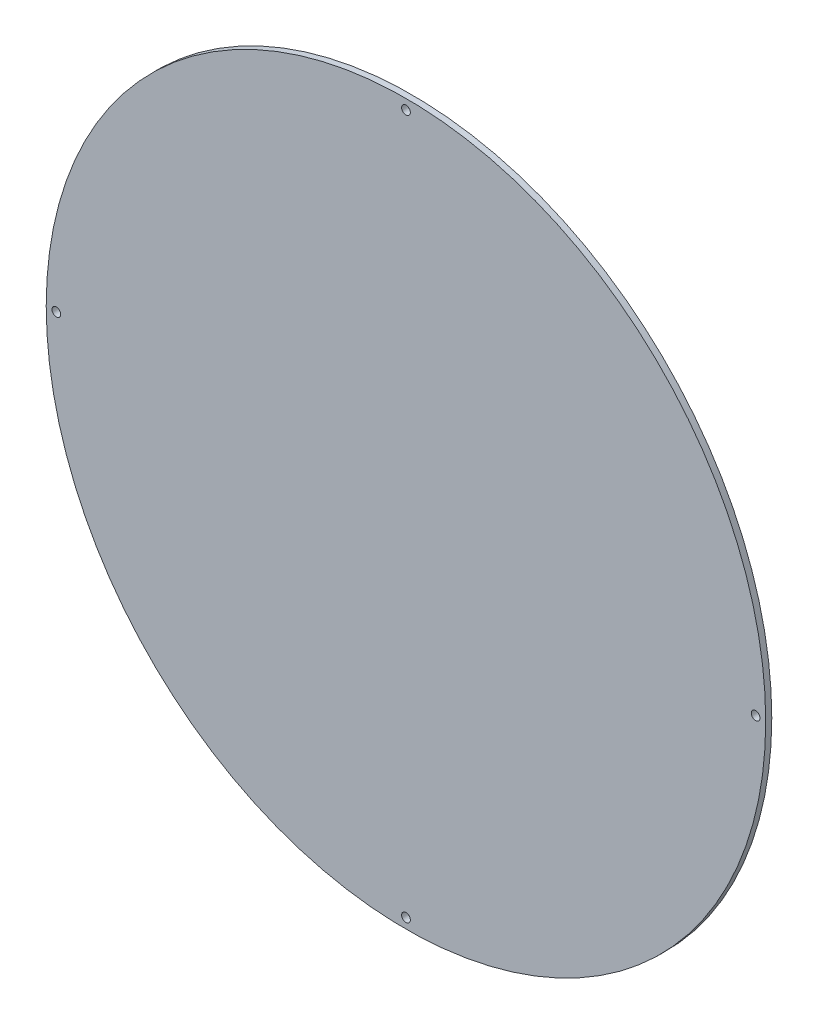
ISO-10303-21;
HEADER;
FILE_DESCRIPTION(('STEP AP214'),'2;1');
FILE_NAME('part.step','',(''),(''),'','','');
FILE_SCHEMA(('AUTOMOTIVE_DESIGN { 1 0 10303 214 1 1 1 1 }'));
ENDSEC;
DATA;
#1=APPLICATION_CONTEXT('core data for automotive mechanical design processes');
#2=APPLICATION_PROTOCOL_DEFINITION('international standard','automotive_design',2000,#1);
#3=PRODUCT_CONTEXT('',#1,'mechanical');
#4=PRODUCT('Part','Part','',(#3));
#5=PRODUCT_RELATED_PRODUCT_CATEGORY('part','',(#4));
#6=PRODUCT_DEFINITION_FORMATION('','',#4);
#7=PRODUCT_DEFINITION_CONTEXT('part definition',#1,'design');
#8=PRODUCT_DEFINITION('design','',#6,#7);
#9=PRODUCT_DEFINITION_SHAPE('','',#8);
#10=(LENGTH_UNIT() NAMED_UNIT(*) SI_UNIT(.MILLI.,.METRE.));
#11=(NAMED_UNIT(*) PLANE_ANGLE_UNIT() SI_UNIT($,.RADIAN.));
#12=(NAMED_UNIT(*) SI_UNIT($,.STERADIAN.) SOLID_ANGLE_UNIT());
#13=UNCERTAINTY_MEASURE_WITH_UNIT(LENGTH_MEASURE(1.E-05),#10,'distance_accuracy_value','');
#14=(GEOMETRIC_REPRESENTATION_CONTEXT(3) GLOBAL_UNCERTAINTY_ASSIGNED_CONTEXT((#13)) GLOBAL_UNIT_ASSIGNED_CONTEXT((#10,
#11,#12)) REPRESENTATION_CONTEXT('',''));
#15=CARTESIAN_POINT('',(0.,0.,0.));
#16=DIRECTION('',(0.,0.,1.));
#17=DIRECTION('',(1.,0.,0.));
#18=AXIS2_PLACEMENT_3D('',#15,#16,#17);
#19=CARTESIAN_POINT('',(0.,0.,3.00000000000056));
#20=DIRECTION('',(0.,0.,-1.));
#21=DIRECTION('',(-1.,0.,0.));
#22=AXIS2_PLACEMENT_3D('',#19,#20,#21);
#23=CYLINDRICAL_SURFACE('',#22,177.8);
#24=CARTESIAN_POINT('',(0.,0.,3.00000000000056));
#25=DIRECTION('',(0.,0.,1.));
#26=DIRECTION('',(1.,0.,0.));
#27=AXIS2_PLACEMENT_3D('',#24,#25,#26);
#28=CIRCLE('',#27,177.8);
#29=CARTESIAN_POINT('',(177.8,0.,3.00000000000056));
#30=VERTEX_POINT('',#29);
#31=EDGE_CURVE('E10',#30,#30,#28,.T.);
#32=ORIENTED_EDGE('',*,*,#31,.F.);
#33=EDGE_LOOP('',(#32));
#34=FACE_BOUND('',#33,.T.);
#35=CARTESIAN_POINT('',(0.,0.,0.));
#36=DIRECTION('',(0.,0.,1.));
#37=DIRECTION('',(1.,0.,0.));
#38=AXIS2_PLACEMENT_3D('',#35,#36,#37);
#39=CIRCLE('',#38,177.8);
#40=CARTESIAN_POINT('',(177.8,0.,0.));
#41=VERTEX_POINT('',#40);
#42=EDGE_CURVE('E44',#41,#41,#39,.T.);
#43=ORIENTED_EDGE('',*,*,#42,.T.);
#44=EDGE_LOOP('',(#43));
#45=FACE_BOUND('',#44,.T.);
#46=ADVANCED_FACE('F37',(#34,#45),#23,.T.);
#47=CARTESIAN_POINT('',(0.,0.,3.00000000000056));
#48=DIRECTION('',(0.,0.,1.));
#49=DIRECTION('',(1.,0.,0.));
#50=AXIS2_PLACEMENT_3D('',#47,#48,#49);
#51=PLANE('',#50);
#52=CARTESIAN_POINT('',(1.19348975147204E-12,-172.8,3.00000000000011));
#53=DIRECTION('',(0.,0.,1.));
#54=DIRECTION('',(0.,-1.,0.));
#55=AXIS2_PLACEMENT_3D('',#52,#53,#54);
#56=CIRCLE('',#55,2.14999999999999);
#57=CARTESIAN_POINT('',(1.21591057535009E-12,-174.95,3.00000000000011));
#58=VERTEX_POINT('',#57);
#59=EDGE_CURVE('E68',#58,#58,#56,.T.);
#60=ORIENTED_EDGE('',*,*,#59,.F.);
#61=EDGE_LOOP('',(#60));
#62=FACE_BOUND('',#61,.T.);
#63=CARTESIAN_POINT('',(-172.8,5.55111512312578E-13,2.99999999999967));
#64=DIRECTION('',(0.,0.,1.));
#65=DIRECTION('',(-1.,0.,0.));
#66=AXIS2_PLACEMENT_3D('',#63,#64,#65);
#67=CIRCLE('',#66,2.14999999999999);
#68=CARTESIAN_POINT('',(-174.95,5.55016406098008E-13,2.99999999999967));
#69=VERTEX_POINT('',#68);
#70=EDGE_CURVE('E62',#69,#69,#67,.T.);
#71=ORIENTED_EDGE('',*,*,#70,.F.);
#72=EDGE_LOOP('',(#71));
#73=FACE_BOUND('',#72,.T.);
#74=CARTESIAN_POINT('',(0.,172.8,2.99999999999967));
#75=DIRECTION('',(0.,0.,1.));
#76=DIRECTION('',(0.,1.,0.));
#77=AXIS2_PLACEMENT_3D('',#74,#75,#76);
#78=CIRCLE('',#77,2.14999999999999);
#79=CARTESIAN_POINT('',(0.,174.95,2.99999999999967));
#80=VERTEX_POINT('',#79);
#81=EDGE_CURVE('E56',#80,#80,#78,.T.);
#82=ORIENTED_EDGE('',*,*,#81,.F.);
#83=EDGE_LOOP('',(#82));
#84=FACE_BOUND('',#83,.T.);
#85=CARTESIAN_POINT('',(172.8,-6.66133814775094E-13,2.99999999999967));
#86=DIRECTION('',(0.,0.,1.));
#87=DIRECTION('',(1.,0.,0.));
#88=AXIS2_PLACEMENT_3D('',#85,#86,#87);
#89=CIRCLE('',#88,2.14999999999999);
#90=CARTESIAN_POINT('',(174.95,-6.66038708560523E-13,2.99999999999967));
#91=VERTEX_POINT('',#90);
#92=EDGE_CURVE('E50',#91,#91,#89,.T.);
#93=ORIENTED_EDGE('',*,*,#92,.F.);
#94=EDGE_LOOP('',(#93));
#95=FACE_BOUND('',#94,.T.);
#96=ORIENTED_EDGE('',*,*,#31,.T.);
#97=EDGE_LOOP('',(#96));
#98=FACE_BOUND('',#97,.T.);
#99=ADVANCED_FACE('F75',(#62,#73,#84,#95,#98),#51,.T.);
#100=CARTESIAN_POINT('',(0.,0.,0.));
#101=DIRECTION('',(0.,0.,1.));
#102=DIRECTION('',(1.,0.,0.));
#103=AXIS2_PLACEMENT_3D('',#100,#101,#102);
#104=PLANE('',#103);
#105=CARTESIAN_POINT('',(1.27675647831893E-12,-172.8,0.));
#106=DIRECTION('',(0.,0.,1.));
#107=DIRECTION('',(0.,-1.,0.));
#108=AXIS2_PLACEMENT_3D('',#105,#106,#107);
#109=CIRCLE('',#108,2.14999999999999);
#110=CARTESIAN_POINT('',(1.29917730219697E-12,-174.95,0.));
#111=VERTEX_POINT('',#110);
#112=EDGE_CURVE('E65',#111,#111,#109,.T.);
#113=ORIENTED_EDGE('',*,*,#112,.T.);
#114=EDGE_LOOP('',(#113));
#115=FACE_BOUND('',#114,.T.);
#116=CARTESIAN_POINT('',(-172.8,5.55111512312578E-13,0.));
#117=DIRECTION('',(0.,0.,1.));
#118=DIRECTION('',(-1.,0.,0.));
#119=AXIS2_PLACEMENT_3D('',#116,#117,#118);
#120=CIRCLE('',#119,2.14999999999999);
#121=CARTESIAN_POINT('',(-174.95,5.55016406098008E-13,0.));
#122=VERTEX_POINT('',#121);
#123=EDGE_CURVE('E59',#122,#122,#120,.T.);
#124=ORIENTED_EDGE('',*,*,#123,.T.);
#125=EDGE_LOOP('',(#124));
#126=FACE_BOUND('',#125,.T.);
#127=CARTESIAN_POINT('',(0.,172.8,4.44089209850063E-13));
#128=DIRECTION('',(0.,0.,1.));
#129=DIRECTION('',(0.,1.,0.));
#130=AXIS2_PLACEMENT_3D('',#127,#128,#129);
#131=CIRCLE('',#130,2.14999999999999);
#132=CARTESIAN_POINT('',(0.,174.95,4.43940023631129E-13));
#133=VERTEX_POINT('',#132);
#134=EDGE_CURVE('E53',#133,#133,#131,.T.);
#135=ORIENTED_EDGE('',*,*,#134,.T.);
#136=EDGE_LOOP('',(#135));
#137=FACE_BOUND('',#136,.T.);
#138=CARTESIAN_POINT('',(172.8,-6.66133814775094E-13,-4.44089209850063E-13));
#139=DIRECTION('',(0.,0.,1.));
#140=DIRECTION('',(1.,0.,0.));
#141=AXIS2_PLACEMENT_3D('',#138,#139,#140);
#142=CIRCLE('',#141,2.14999999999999);
#143=CARTESIAN_POINT('',(174.95,-6.66038708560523E-13,-4.44029535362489E-13));
#144=VERTEX_POINT('',#143);
#145=EDGE_CURVE('E40',#144,#144,#142,.T.);
#146=ORIENTED_EDGE('',*,*,#145,.T.);
#147=EDGE_LOOP('',(#146));
#148=FACE_BOUND('',#147,.T.);
#149=ORIENTED_EDGE('',*,*,#42,.F.);
#150=EDGE_LOOP('',(#149));
#151=FACE_BOUND('',#150,.T.);
#152=ADVANCED_FACE('F78',(#115,#126,#137,#148,#151),#104,.F.);
#153=CARTESIAN_POINT('',(172.8,-6.66133814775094E-13,2.99999999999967));
#154=DIRECTION('',(0.,0.,1.));
#155=DIRECTION('',(1.,0.,0.));
#156=AXIS2_PLACEMENT_3D('',#153,#154,#155);
#157=CYLINDRICAL_SURFACE('',#156,2.14999999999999);
#158=ORIENTED_EDGE('',*,*,#92,.T.);
#159=EDGE_LOOP('',(#158));
#160=FACE_BOUND('',#159,.T.);
#161=ORIENTED_EDGE('',*,*,#145,.F.);
#162=EDGE_LOOP('',(#161));
#163=FACE_BOUND('',#162,.T.);
#164=ADVANCED_FACE('F86',(#160,#163),#157,.F.);
#165=CARTESIAN_POINT('',(0.,172.8,2.99999999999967));
#166=DIRECTION('',(0.,0.,1.));
#167=DIRECTION('',(0.,1.,0.));
#168=AXIS2_PLACEMENT_3D('',#165,#166,#167);
#169=CYLINDRICAL_SURFACE('',#168,2.14999999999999);
#170=ORIENTED_EDGE('',*,*,#81,.T.);
#171=EDGE_LOOP('',(#170));
#172=FACE_BOUND('',#171,.T.);
#173=ORIENTED_EDGE('',*,*,#134,.F.);
#174=EDGE_LOOP('',(#173));
#175=FACE_BOUND('',#174,.T.);
#176=ADVANCED_FACE('F89',(#172,#175),#169,.F.);
#177=CARTESIAN_POINT('',(-172.8,5.55111512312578E-13,2.99999999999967));
#178=DIRECTION('',(0.,0.,1.));
#179=DIRECTION('',(-1.,0.,0.));
#180=AXIS2_PLACEMENT_3D('',#177,#178,#179);
#181=CYLINDRICAL_SURFACE('',#180,2.14999999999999);
#182=ORIENTED_EDGE('',*,*,#70,.T.);
#183=EDGE_LOOP('',(#182));
#184=FACE_BOUND('',#183,.T.);
#185=ORIENTED_EDGE('',*,*,#123,.F.);
#186=EDGE_LOOP('',(#185));
#187=FACE_BOUND('',#186,.T.);
#188=ADVANCED_FACE('F121',(#184,#187),#181,.F.);
#189=CARTESIAN_POINT('',(1.19348975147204E-12,-172.8,3.00000000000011));
#190=DIRECTION('',(0.,0.,1.));
#191=DIRECTION('',(0.,-1.,0.));
#192=AXIS2_PLACEMENT_3D('',#189,#190,#191);
#193=CYLINDRICAL_SURFACE('',#192,2.14999999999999);
#194=ORIENTED_EDGE('',*,*,#59,.T.);
#195=EDGE_LOOP('',(#194));
#196=FACE_BOUND('',#195,.T.);
#197=ORIENTED_EDGE('',*,*,#112,.F.);
#198=EDGE_LOOP('',(#197));
#199=FACE_BOUND('',#198,.T.);
#200=ADVANCED_FACE('F72',(#196,#199),#193,.F.);
#201=CLOSED_SHELL('',(#46,#99,#152,#164,#176,#188,#200));
#202=MANIFOLD_SOLID_BREP('B2',#201);
#203=ADVANCED_BREP_SHAPE_REPRESENTATION('',(#18,#202),#14);
#204=SHAPE_DEFINITION_REPRESENTATION(#9,#203);
ENDSEC;
END-ISO-10303-21;
